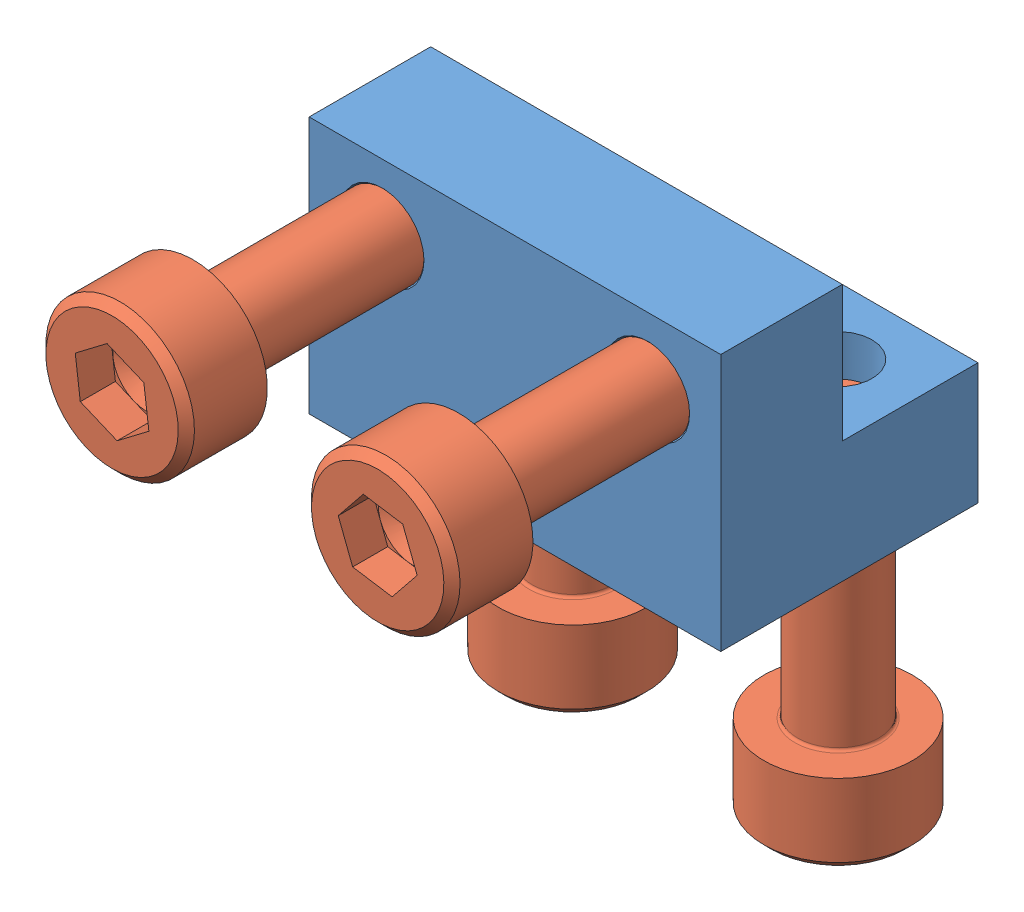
SolidWorks assembly 85664.SLDASM, configuration Default (file format 4700). Lengths in mm.
Overall size (17.25 20.92 20.92).
5 component instances, 2 part files, 9 mates.
Components (placement in the parent):
- 85664-1: 85664.SLDPRT [Default] at (-25.1776 1.211 9.9691) size (15.24 9.53 9.53)
- M3x10 SHCS included-1: M3x10 SHCS included.SLDPRT [B18.3.1M - 3 x 0.5 x 10 Hex SHCS -- 10NHX] at (-22.4751 8.261 19.9691) x (0 0 -1) z (-0.99205 -0.125844 0) size (13 5.5 5.5)
- M3x10 SHCS included-6: M3x10 SHCS included.SLDPRT [B18.3.1M - 3 x 0.5 x 10 Hex SHCS -- 10NHX] at (-12.6401 8.261 19.9691) x (0 0 -1) z (-0.778965 0.627068 0) size (13 5.5 5.5)
- M3x10 SHCS included-5: M3x10 SHCS included.SLDPRT [B18.3.1M - 3 x 0.5 x 10 Hex SHCS -- 10NHX] at (-12.6401 -8.789 2.9191) x (0 1 0) z (-0.778965 0 0.627068) size (13 5.5 5.5)
- M3x10 SHCS included-4: M3x10 SHCS included.SLDPRT [B18.3.1M - 3 x 0.5 x 10 Hex SHCS -- 10NHX] at (-22.4751 -8.789 2.9191) x (0 1 0) z (-0.35323 0 0.935536) size (13 5.5 5.5)
Mates (geometry in assembly coordinates):
- Concentric5: concentric: cylinder of 85664-1 through (-22.4751 8.261 9.9691) axis (0 0 1) radius 1.25; cylinder of M3x10 SHCS included-1 through (-22.4751 8.261 51.7191) axis (0 0 1) radius 1.5
- Distance1: distance = 7 mm: plane of M3x10 SHCS included-1 through (-22.129 5.5329 16.9691) normal (0 0 -1); plane of 85664-1 through (-9.9376 5.9735 9.9691) normal (0 0 1)
- Distance2: distance = 7 mm: plane of 85664-1 through (-9.9376 5.9735 9.9691) normal (0 0 1); plane of M3x10 SHCS included-6 through (-14.3645 6.1189 16.9691) normal (0 0 -1)
- Distance3: distance = 7 mm: plane of M3x10 SHCS included-4 through (-25.0478 -5.789 1.9477) normal (0 1 0); plane of 85664-1 through (-9.9376 1.211 -5.4123) normal (0 -1 0)
- Distance4: distance = 7 mm: plane of M3x10 SHCS included-5 through (-14.3645 -5.789 0.7769) normal (0 1 0); plane of 85664-1 through (-9.9376 1.211 -5.4123) normal (0 -1 0)
- Concentric6: concentric aligned: cylinder of 85664-1 through (-22.4751 8.261 9.9691) axis (0 0 1) radius 1.25; cylinder of M3x10 SHCS included-1 through (-22.4751 8.261 51.7191) axis (0 0 1) radius 1.5
- Concentric7: concentric aligned: cylinder of 85664-1 through (-12.6401 8.261 9.9691) axis (0 0 1) radius 1.25; cylinder of M3x10 SHCS included-6 through (-12.6401 8.261 51.7191) axis (0 0 1) radius 1.5
- Concentric8: concentric aligned: cylinder of 85664-1 through (-12.6401 1.211 2.9191) axis (0 -1 0) radius 1.25; cylinder of M3x10 SHCS included-5 through (-12.6401 -40.539 2.9191) axis (0 -1 0) radius 1.5
- Concentric9: concentric aligned: cylinder of 85664-1 through (-22.4751 1.211 2.9191) axis (0 -1 0) radius 1.25; cylinder of M3x10 SHCS included-4 through (-22.4751 -40.539 2.9191) axis (0 -1 0) radius 1.5
